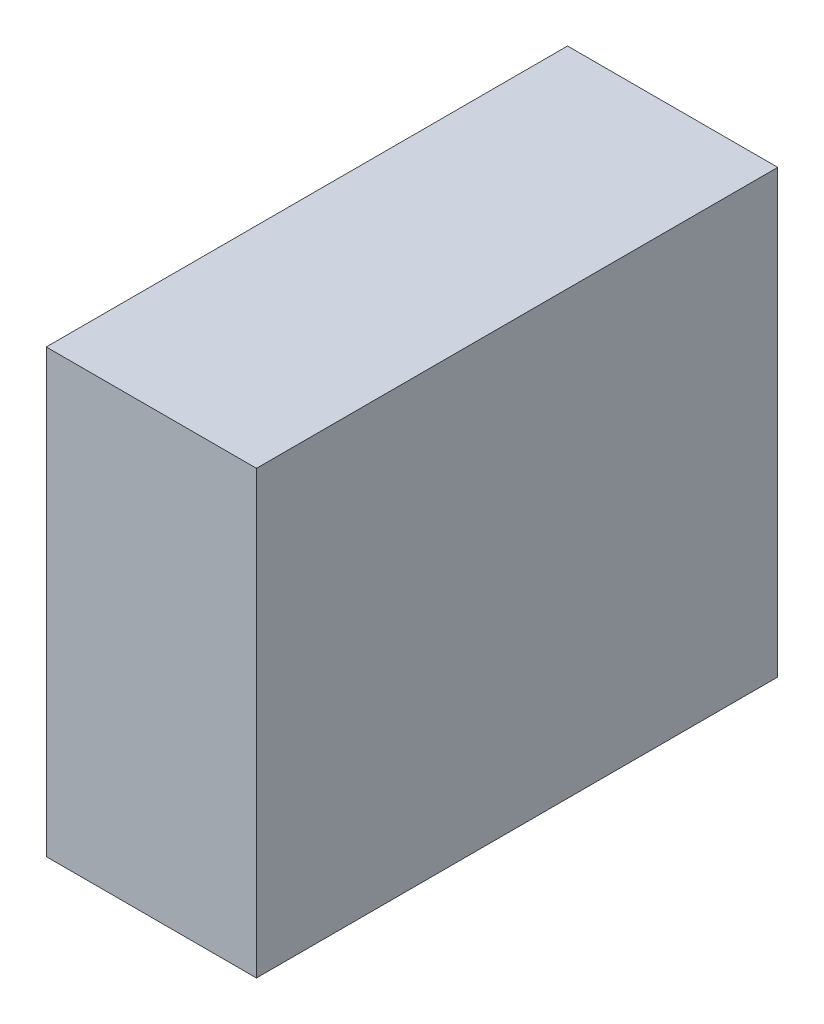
ISO-10303-21;
HEADER;
FILE_DESCRIPTION(('STEP AP214'),'2;1');
FILE_NAME('part.step','',(''),(''),'','','');
FILE_SCHEMA(('AUTOMOTIVE_DESIGN { 1 0 10303 214 1 1 1 1 }'));
ENDSEC;
DATA;
#1=APPLICATION_CONTEXT('core data for automotive mechanical design processes');
#2=APPLICATION_PROTOCOL_DEFINITION('international standard','automotive_design',2000,#1);
#3=PRODUCT_CONTEXT('',#1,'mechanical');
#4=PRODUCT('Part','Part','',(#3));
#5=PRODUCT_RELATED_PRODUCT_CATEGORY('part','',(#4));
#6=PRODUCT_DEFINITION_FORMATION('','',#4);
#7=PRODUCT_DEFINITION_CONTEXT('part definition',#1,'design');
#8=PRODUCT_DEFINITION('design','',#6,#7);
#9=PRODUCT_DEFINITION_SHAPE('','',#8);
#10=(LENGTH_UNIT() NAMED_UNIT(*) SI_UNIT(.MILLI.,.METRE.));
#11=(NAMED_UNIT(*) PLANE_ANGLE_UNIT() SI_UNIT($,.RADIAN.));
#12=(NAMED_UNIT(*) SI_UNIT($,.STERADIAN.) SOLID_ANGLE_UNIT());
#13=UNCERTAINTY_MEASURE_WITH_UNIT(LENGTH_MEASURE(1.E-05),#10,'distance_accuracy_value','');
#14=(GEOMETRIC_REPRESENTATION_CONTEXT(3) GLOBAL_UNCERTAINTY_ASSIGNED_CONTEXT((#13)) GLOBAL_UNIT_ASSIGNED_CONTEXT((#10,
#11,#12)) REPRESENTATION_CONTEXT('',''));
#15=CARTESIAN_POINT('',(0.,0.,0.));
#16=DIRECTION('',(0.,0.,1.));
#17=DIRECTION('',(1.,0.,0.));
#18=AXIS2_PLACEMENT_3D('',#15,#16,#17);
#19=CARTESIAN_POINT('',(-25.,105.,-62.));
#20=DIRECTION('',(1.,0.,0.));
#21=DIRECTION('',(0.,0.,-1.));
#22=AXIS2_PLACEMENT_3D('',#19,#20,#21);
#23=PLANE('',#22);
#24=DIRECTION('',(0.,0.,1.));
#25=VECTOR('',#24,1.);
#26=CARTESIAN_POINT('',(-25.,0.,-62.));
#27=LINE('',#26,#25);
#28=CARTESIAN_POINT('',(-25.,0.,-62.));
#29=VERTEX_POINT('',#28);
#30=CARTESIAN_POINT('',(-25.,0.,62.));
#31=VERTEX_POINT('',#30);
#32=EDGE_CURVE('E73',#29,#31,#27,.T.);
#33=ORIENTED_EDGE('',*,*,#32,.T.);
#34=DIRECTION('',(0.,-1.,0.));
#35=VECTOR('',#34,1.);
#36=CARTESIAN_POINT('',(-25.,105.,62.));
#37=LINE('',#36,#35);
#38=CARTESIAN_POINT('',(-25.,105.,62.));
#39=VERTEX_POINT('',#38);
#40=EDGE_CURVE('E11',#39,#31,#37,.T.);
#41=ORIENTED_EDGE('',*,*,#40,.F.);
#42=DIRECTION('',(0.,0.,1.));
#43=VECTOR('',#42,1.);
#44=CARTESIAN_POINT('',(-25.,105.,-62.));
#45=LINE('',#44,#43);
#46=CARTESIAN_POINT('',(-25.,105.,-62.));
#47=VERTEX_POINT('',#46);
#48=EDGE_CURVE('E91',#47,#39,#45,.T.);
#49=ORIENTED_EDGE('',*,*,#48,.F.);
#50=DIRECTION('',(0.,-1.,0.));
#51=VECTOR('',#50,1.);
#52=CARTESIAN_POINT('',(-25.,105.,-62.));
#53=LINE('',#52,#51);
#54=EDGE_CURVE('E85',#47,#29,#53,.T.);
#55=ORIENTED_EDGE('',*,*,#54,.T.);
#56=EDGE_LOOP('',(#33,#41,#49,#55));
#57=FACE_BOUND('',#56,.T.);
#58=ADVANCED_FACE('F29',(#57),#23,.F.);
#59=CARTESIAN_POINT('',(-25.,105.,62.));
#60=DIRECTION('',(0.,0.,-1.));
#61=DIRECTION('',(-1.,0.,0.));
#62=AXIS2_PLACEMENT_3D('',#59,#60,#61);
#63=PLANE('',#62);
#64=DIRECTION('',(1.,0.,0.));
#65=VECTOR('',#64,1.);
#66=CARTESIAN_POINT('',(-25.,0.,62.));
#67=LINE('',#66,#65);
#68=CARTESIAN_POINT('',(25.,0.,62.));
#69=VERTEX_POINT('',#68);
#70=EDGE_CURVE('E69',#31,#69,#67,.T.);
#71=ORIENTED_EDGE('',*,*,#70,.T.);
#72=DIRECTION('',(0.,-1.,0.));
#73=VECTOR('',#72,1.);
#74=CARTESIAN_POINT('',(25.,105.,62.));
#75=LINE('',#74,#73);
#76=CARTESIAN_POINT('',(25.,105.,62.));
#77=VERTEX_POINT('',#76);
#78=EDGE_CURVE('E36',#77,#69,#75,.T.);
#79=ORIENTED_EDGE('',*,*,#78,.F.);
#80=DIRECTION('',(1.,0.,0.));
#81=VECTOR('',#80,1.);
#82=CARTESIAN_POINT('',(-25.,105.,62.));
#83=LINE('',#82,#81);
#84=EDGE_CURVE('E81',#39,#77,#83,.T.);
#85=ORIENTED_EDGE('',*,*,#84,.F.);
#86=ORIENTED_EDGE('',*,*,#40,.T.);
#87=EDGE_LOOP('',(#71,#79,#85,#86));
#88=FACE_BOUND('',#87,.T.);
#89=ADVANCED_FACE('F80',(#88),#63,.F.);
#90=CARTESIAN_POINT('',(25.,105.,-62.));
#91=DIRECTION('',(-1.,0.,0.));
#92=DIRECTION('',(0.,0.,1.));
#93=AXIS2_PLACEMENT_3D('',#90,#91,#92);
#94=PLANE('',#93);
#95=DIRECTION('',(0.,0.,-1.));
#96=VECTOR('',#95,1.);
#97=CARTESIAN_POINT('',(25.,0.,-62.));
#98=LINE('',#97,#96);
#99=CARTESIAN_POINT('',(25.,0.,-62.));
#100=VERTEX_POINT('',#99);
#101=EDGE_CURVE('E74',#69,#100,#98,.T.);
#102=ORIENTED_EDGE('',*,*,#101,.T.);
#103=DIRECTION('',(0.,-1.,0.));
#104=VECTOR('',#103,1.);
#105=CARTESIAN_POINT('',(25.,105.,-62.));
#106=LINE('',#105,#104);
#107=CARTESIAN_POINT('',(25.,105.,-62.));
#108=VERTEX_POINT('',#107);
#109=EDGE_CURVE('E97',#108,#100,#106,.T.);
#110=ORIENTED_EDGE('',*,*,#109,.F.);
#111=DIRECTION('',(0.,0.,-1.));
#112=VECTOR('',#111,1.);
#113=CARTESIAN_POINT('',(25.,105.,-62.));
#114=LINE('',#113,#112);
#115=EDGE_CURVE('E48',#77,#108,#114,.T.);
#116=ORIENTED_EDGE('',*,*,#115,.F.);
#117=ORIENTED_EDGE('',*,*,#78,.T.);
#118=EDGE_LOOP('',(#102,#110,#116,#117));
#119=FACE_BOUND('',#118,.T.);
#120=ADVANCED_FACE('F100',(#119),#94,.F.);
#121=CARTESIAN_POINT('',(-25.,105.,-62.));
#122=DIRECTION('',(0.,0.,1.));
#123=DIRECTION('',(1.,0.,0.));
#124=AXIS2_PLACEMENT_3D('',#121,#122,#123);
#125=PLANE('',#124);
#126=DIRECTION('',(-1.,0.,0.));
#127=VECTOR('',#126,1.);
#128=CARTESIAN_POINT('',(-25.,0.,-62.));
#129=LINE('',#128,#127);
#130=EDGE_CURVE('E89',#100,#29,#129,.T.);
#131=ORIENTED_EDGE('',*,*,#130,.T.);
#132=ORIENTED_EDGE('',*,*,#54,.F.);
#133=DIRECTION('',(-1.,0.,0.));
#134=VECTOR('',#133,1.);
#135=CARTESIAN_POINT('',(-25.,105.,-62.));
#136=LINE('',#135,#134);
#137=EDGE_CURVE('E43',#108,#47,#136,.T.);
#138=ORIENTED_EDGE('',*,*,#137,.F.);
#139=ORIENTED_EDGE('',*,*,#109,.T.);
#140=EDGE_LOOP('',(#131,#132,#138,#139));
#141=FACE_BOUND('',#140,.T.);
#142=ADVANCED_FACE('F102',(#141),#125,.F.);
#143=CARTESIAN_POINT('',(-25.,105.,62.));
#144=DIRECTION('',(0.,1.,0.));
#145=DIRECTION('',(0.,0.,1.));
#146=AXIS2_PLACEMENT_3D('',#143,#144,#145);
#147=PLANE('',#146);
#148=ORIENTED_EDGE('',*,*,#48,.T.);
#149=ORIENTED_EDGE('',*,*,#84,.T.);
#150=ORIENTED_EDGE('',*,*,#115,.T.);
#151=ORIENTED_EDGE('',*,*,#137,.T.);
#152=EDGE_LOOP('',(#148,#149,#150,#151));
#153=FACE_BOUND('',#152,.T.);
#154=ADVANCED_FACE('F103',(#153),#147,.T.);
#155=CARTESIAN_POINT('',(-25.,0.,62.));
#156=DIRECTION('',(0.,1.,0.));
#157=DIRECTION('',(0.,0.,1.));
#158=AXIS2_PLACEMENT_3D('',#155,#156,#157);
#159=PLANE('',#158);
#160=ORIENTED_EDGE('',*,*,#32,.F.);
#161=ORIENTED_EDGE('',*,*,#130,.F.);
#162=ORIENTED_EDGE('',*,*,#101,.F.);
#163=ORIENTED_EDGE('',*,*,#70,.F.);
#164=EDGE_LOOP('',(#160,#161,#162,#163));
#165=FACE_BOUND('',#164,.T.);
#166=ADVANCED_FACE('F70',(#165),#159,.F.);
#167=CLOSED_SHELL('',(#58,#89,#120,#142,#154,#166));
#168=MANIFOLD_SOLID_BREP('B2',#167);
#169=ADVANCED_BREP_SHAPE_REPRESENTATION('',(#18,#168),#14);
#170=SHAPE_DEFINITION_REPRESENTATION(#9,#169);
ENDSEC;
END-ISO-10303-21;
